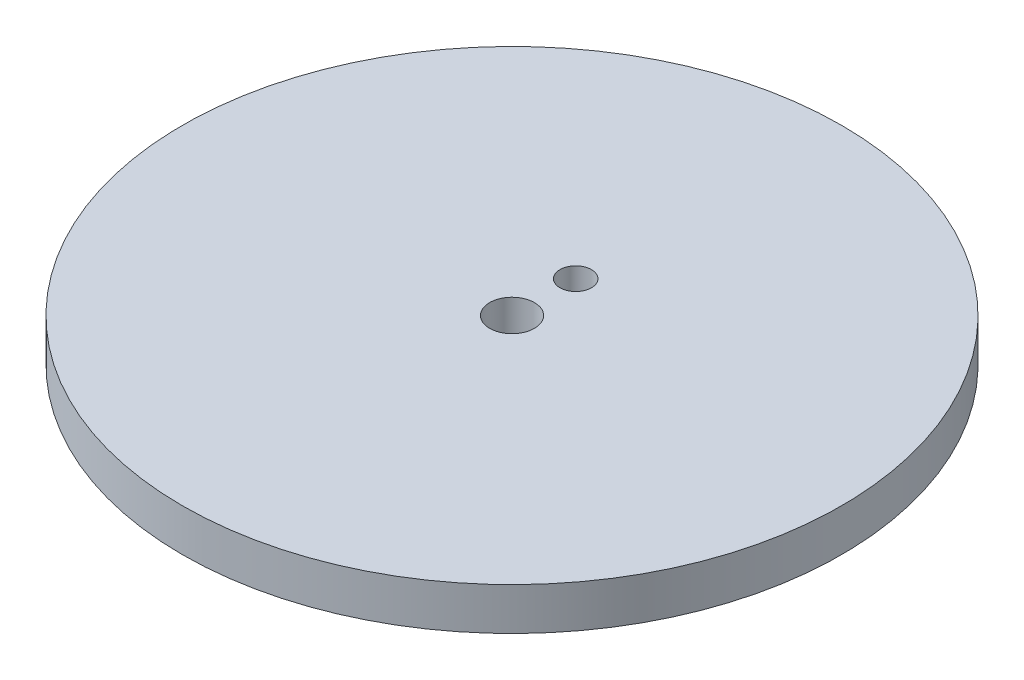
from build123d import *

# Parameters (mm, degrees)
BASE_SKETCH_R             = 70
EXTRUDE_BASE_DEPTH        = 9
TRIPOD_SCREW_LOCATION_R   = 4.75
TRIPOD_SCREW_LOCATION_R_2 = 3.345362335
CUT_TRIPOD_SCREW_DEPTH    = 8
CAMERA_SCREW_LOCATION_R   = 3.1
CUT_CAMERA_SCREWS_DEPTH   = 8


with BuildPart() as part:
    # Base Sketch → Extrude Base (new body)
    with BuildSketch(Plane(origin=(0, 0, 0), x_dir=(1, 0, 0), z_dir=(0, 1, 0))):
        with Locations(Location((0, 0, 0), (0, 0, 270))):
            Circle(BASE_SKETCH_R)
    extrude(amount=EXTRUDE_BASE_DEPTH)

    # Tripod Screw Location → Cut Tripod Screw (cut)
    with BuildSketch(Plane(origin=(0, 9, 0), x_dir=(1, 0, 0), z_dir=(0, 1, 0))):
        with Locations(Location((-0.01036168, 0.016257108, 0), (0, 0, 270))):
            Circle(TRIPOD_SCREW_LOCATION_R)
        with Locations(Location((-0.01036168, 13.544592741, 0), (0, 0, 270))):
            Circle(TRIPOD_SCREW_LOCATION_R_2)
    extrude(amount=-CUT_TRIPOD_SCREW_DEPTH, mode=Mode.SUBTRACT)

    # Camera Screw Location → Cut Camera Screws (cut)
    with BuildSketch(Plane.XZ):
        with Locations(Location((0, 63.38854937, 0), (0, 0, 270))):
            Circle(CAMERA_SCREW_LOCATION_R)
        with Locations(Location((54.896094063, -31.694274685, 0), (0, 0, 270))):
            Circle(CAMERA_SCREW_LOCATION_R)
        with Locations(Location((-54.896094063, -31.694274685, 0), (0, 0, 270))):
            Circle(CAMERA_SCREW_LOCATION_R)
    extrude(amount=-CUT_CAMERA_SCREWS_DEPTH, mode=Mode.SUBTRACT)


solid = part.part
